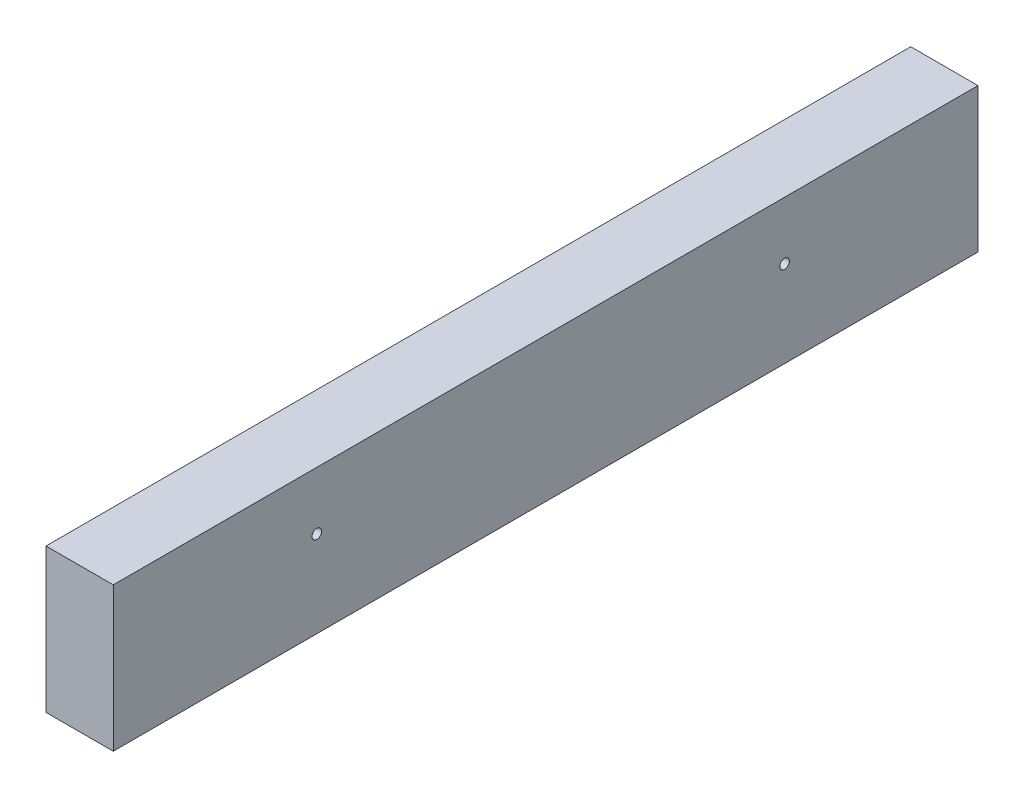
ISO-10303-21;
HEADER;
FILE_DESCRIPTION(('STEP AP214'),'2;1');
FILE_NAME('part.step','',(''),(''),'','','');
FILE_SCHEMA(('AUTOMOTIVE_DESIGN { 1 0 10303 214 1 1 1 1 }'));
ENDSEC;
DATA;
#1=APPLICATION_CONTEXT('core data for automotive mechanical design processes');
#2=APPLICATION_PROTOCOL_DEFINITION('international standard','automotive_design',2000,#1);
#3=PRODUCT_CONTEXT('',#1,'mechanical');
#4=PRODUCT('Part','Part','',(#3));
#5=PRODUCT_RELATED_PRODUCT_CATEGORY('part','',(#4));
#6=PRODUCT_DEFINITION_FORMATION('','',#4);
#7=PRODUCT_DEFINITION_CONTEXT('part definition',#1,'design');
#8=PRODUCT_DEFINITION('design','',#6,#7);
#9=PRODUCT_DEFINITION_SHAPE('','',#8);
#10=(LENGTH_UNIT() NAMED_UNIT(*) SI_UNIT(.MILLI.,.METRE.));
#11=(NAMED_UNIT(*) PLANE_ANGLE_UNIT() SI_UNIT($,.RADIAN.));
#12=(NAMED_UNIT(*) SI_UNIT($,.STERADIAN.) SOLID_ANGLE_UNIT());
#13=UNCERTAINTY_MEASURE_WITH_UNIT(LENGTH_MEASURE(1.E-05),#10,'distance_accuracy_value','');
#14=(GEOMETRIC_REPRESENTATION_CONTEXT(3) GLOBAL_UNCERTAINTY_ASSIGNED_CONTEXT((#13)) GLOBAL_UNIT_ASSIGNED_CONTEXT((#10,
#11,#12)) REPRESENTATION_CONTEXT('',''));
#15=CARTESIAN_POINT('',(0.,0.,0.));
#16=DIRECTION('',(0.,0.,1.));
#17=DIRECTION('',(1.,0.,0.));
#18=AXIS2_PLACEMENT_3D('',#15,#16,#17);
#19=CARTESIAN_POINT('',(-9.398,566.112211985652,-360.901203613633));
#20=DIRECTION('',(1.,0.,0.));
#21=DIRECTION('',(0.,0.,-1.));
#22=AXIS2_PLACEMENT_3D('',#19,#20,#21);
#23=PLANE('',#22);
#24=CARTESIAN_POINT('',(-9.398,566.112211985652,-360.901203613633));
#25=DIRECTION('',(1.,0.,0.));
#26=DIRECTION('',(0.,0.,-1.));
#27=AXIS2_PLACEMENT_3D('',#24,#25,#26);
#28=CIRCLE('',#27,1.27000000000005);
#29=CARTESIAN_POINT('',(-9.398,566.112211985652,-362.171203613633));
#30=VERTEX_POINT('',#29);
#31=EDGE_CURVE('E35',#30,#30,#28,.T.);
#32=ORIENTED_EDGE('',*,*,#31,.T.);
#33=EDGE_LOOP('',(#32));
#34=FACE_BOUND('',#33,.T.);
#35=ADVANCED_FACE('F32',(#34),#23,.T.);
#36=CARTESIAN_POINT('',(-9.398,566.112211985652,-237.255677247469));
#37=DIRECTION('',(1.,0.,0.));
#38=DIRECTION('',(0.,0.,-1.));
#39=AXIS2_PLACEMENT_3D('',#36,#37,#38);
#40=PLANE('',#39);
#41=CARTESIAN_POINT('',(-9.398,566.112211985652,-237.255677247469));
#42=DIRECTION('',(1.,0.,0.));
#43=DIRECTION('',(0.,0.,-1.));
#44=AXIS2_PLACEMENT_3D('',#41,#42,#43);
#45=CIRCLE('',#44,1.27000000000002);
#46=CARTESIAN_POINT('',(-9.398,566.112211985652,-238.525677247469));
#47=VERTEX_POINT('',#46);
#48=EDGE_CURVE('E120',#47,#47,#45,.T.);
#49=ORIENTED_EDGE('',*,*,#48,.T.);
#50=EDGE_LOOP('',(#49));
#51=FACE_BOUND('',#50,.T.);
#52=ADVANCED_FACE('F131',(#51),#40,.T.);
#53=CARTESIAN_POINT('',(-9.398,566.112211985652,-360.901203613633));
#54=DIRECTION('',(1.,0.,0.));
#55=DIRECTION('',(0.,0.,-1.));
#56=AXIS2_PLACEMENT_3D('',#53,#54,#55);
#57=CYLINDRICAL_SURFACE('',#56,1.27000000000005);
#58=CARTESIAN_POINT('',(0.,566.112211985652,-360.901203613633));
#59=DIRECTION('',(1.,0.,0.));
#60=DIRECTION('',(0.,0.,-1.));
#61=AXIS2_PLACEMENT_3D('',#58,#59,#60);
#62=CIRCLE('',#61,1.27000000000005);
#63=CARTESIAN_POINT('',(0.,566.112211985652,-362.171203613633));
#64=VERTEX_POINT('',#63);
#65=EDGE_CURVE('E118',#64,#64,#62,.T.);
#66=ORIENTED_EDGE('',*,*,#65,.T.);
#67=EDGE_LOOP('',(#66));
#68=FACE_BOUND('',#67,.T.);
#69=ORIENTED_EDGE('',*,*,#31,.F.);
#70=EDGE_LOOP('',(#69));
#71=FACE_BOUND('',#70,.T.);
#72=ADVANCED_FACE('F128',(#68,#71),#57,.F.);
#73=CARTESIAN_POINT('',(-9.398,566.112211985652,-237.255677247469));
#74=DIRECTION('',(1.,0.,0.));
#75=DIRECTION('',(0.,0.,-1.));
#76=AXIS2_PLACEMENT_3D('',#73,#74,#75);
#77=CYLINDRICAL_SURFACE('',#76,1.27000000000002);
#78=CARTESIAN_POINT('',(0.,566.112211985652,-237.255677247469));
#79=DIRECTION('',(1.,0.,0.));
#80=DIRECTION('',(0.,0.,-1.));
#81=AXIS2_PLACEMENT_3D('',#78,#79,#80);
#82=CIRCLE('',#81,1.27000000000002);
#83=CARTESIAN_POINT('',(0.,566.112211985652,-238.525677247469));
#84=VERTEX_POINT('',#83);
#85=EDGE_CURVE('E81',#84,#84,#82,.T.);
#86=ORIENTED_EDGE('',*,*,#85,.T.);
#87=EDGE_LOOP('',(#86));
#88=FACE_BOUND('',#87,.T.);
#89=ORIENTED_EDGE('',*,*,#48,.F.);
#90=EDGE_LOOP('',(#89));
#91=FACE_BOUND('',#90,.T.);
#92=ADVANCED_FACE('F130',(#88,#91),#77,.F.);
#93=CARTESIAN_POINT('',(0.,0.,0.));
#94=DIRECTION('',(-1.,0.,0.));
#95=DIRECTION('',(0.,0.,1.));
#96=AXIS2_PLACEMENT_3D('',#93,#94,#95);
#97=PLANE('',#96);
#98=DIRECTION('',(0.,1.,0.));
#99=VECTOR('',#98,1.);
#100=CARTESIAN_POINT('',(0.,0.,-412.03537714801));
#101=LINE('',#100,#99);
#102=CARTESIAN_POINT('',(0.,543.252211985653,-412.03537714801));
#103=VERTEX_POINT('',#102);
#104=CARTESIAN_POINT('',(0.,581.352211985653,-412.03537714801));
#105=VERTEX_POINT('',#104);
#106=EDGE_CURVE('E87',#103,#105,#101,.T.);
#107=ORIENTED_EDGE('',*,*,#106,.T.);
#108=DIRECTION('',(0.,0.,-1.));
#109=VECTOR('',#108,1.);
#110=CARTESIAN_POINT('',(0.,581.352211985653,0.));
#111=LINE('',#110,#109);
#112=CARTESIAN_POINT('',(0.,581.352211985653,-183.43537714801));
#113=VERTEX_POINT('',#112);
#114=EDGE_CURVE('E84',#105,#113,#111,.F.);
#115=ORIENTED_EDGE('',*,*,#114,.T.);
#116=DIRECTION('',(0.,-1.,0.));
#117=VECTOR('',#116,1.);
#118=CARTESIAN_POINT('',(0.,0.,-183.43537714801));
#119=LINE('',#118,#117);
#120=CARTESIAN_POINT('',(0.,543.252211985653,-183.43537714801));
#121=VERTEX_POINT('',#120);
#122=EDGE_CURVE('E71',#121,#113,#119,.F.);
#123=ORIENTED_EDGE('',*,*,#122,.F.);
#124=DIRECTION('',(0.,0.,-1.));
#125=VECTOR('',#124,1.);
#126=CARTESIAN_POINT('',(0.,543.252211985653,0.));
#127=LINE('',#126,#125);
#128=EDGE_CURVE('E113',#103,#121,#127,.F.);
#129=ORIENTED_EDGE('',*,*,#128,.F.);
#130=EDGE_LOOP('',(#107,#115,#123,#129));
#131=FACE_BOUND('',#130,.T.);
#132=ORIENTED_EDGE('',*,*,#85,.F.);
#133=EDGE_LOOP('',(#132));
#134=FACE_BOUND('',#133,.T.);
#135=ORIENTED_EDGE('',*,*,#65,.F.);
#136=EDGE_LOOP('',(#135));
#137=FACE_BOUND('',#136,.T.);
#138=ADVANCED_FACE('F85',(#131,#134,#137),#97,.F.);
#139=CARTESIAN_POINT('',(-17.78,0.,-183.43537714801));
#140=DIRECTION('',(0.,0.,1.));
#141=DIRECTION('',(0.,-1.,0.));
#142=AXIS2_PLACEMENT_3D('',#139,#140,#141);
#143=PLANE('',#142);
#144=DIRECTION('',(0.,1.,0.));
#145=VECTOR('',#144,1.);
#146=CARTESIAN_POINT('',(-17.78,0.,-183.43537714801));
#147=LINE('',#146,#145);
#148=CARTESIAN_POINT('',(-17.78,543.252211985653,-183.43537714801));
#149=VERTEX_POINT('',#148);
#150=CARTESIAN_POINT('',(-17.78,581.352211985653,-183.43537714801));
#151=VERTEX_POINT('',#150);
#152=EDGE_CURVE('E106',#149,#151,#147,.T.);
#153=ORIENTED_EDGE('',*,*,#152,.F.);
#154=DIRECTION('',(1.,0.,0.));
#155=VECTOR('',#154,1.);
#156=CARTESIAN_POINT('',(-17.78,543.252211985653,-183.43537714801));
#157=LINE('',#156,#155);
#158=EDGE_CURVE('E78',#121,#149,#157,.F.);
#159=ORIENTED_EDGE('',*,*,#158,.F.);
#160=ORIENTED_EDGE('',*,*,#122,.T.);
#161=DIRECTION('',(1.,0.,0.));
#162=VECTOR('',#161,1.);
#163=CARTESIAN_POINT('',(-17.78,581.352211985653,-183.43537714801));
#164=LINE('',#163,#162);
#165=EDGE_CURVE('E75',#113,#151,#164,.F.);
#166=ORIENTED_EDGE('',*,*,#165,.T.);
#167=EDGE_LOOP('',(#153,#159,#160,#166));
#168=FACE_BOUND('',#167,.T.);
#169=ADVANCED_FACE('F73',(#168),#143,.T.);
#170=CARTESIAN_POINT('',(-17.78,581.352211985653,0.));
#171=DIRECTION('',(0.,-1.,0.));
#172=DIRECTION('',(0.,0.,-1.));
#173=AXIS2_PLACEMENT_3D('',#170,#171,#172);
#174=PLANE('',#173);
#175=DIRECTION('',(1.,0.,0.));
#176=VECTOR('',#175,1.);
#177=CARTESIAN_POINT('',(-17.78,581.352211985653,-412.03537714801));
#178=LINE('',#177,#176);
#179=CARTESIAN_POINT('',(-17.78,581.352211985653,-412.03537714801));
#180=VERTEX_POINT('',#179);
#181=EDGE_CURVE('E90',#105,#180,#178,.F.);
#182=ORIENTED_EDGE('',*,*,#181,.T.);
#183=DIRECTION('',(0.,0.,1.));
#184=VECTOR('',#183,1.);
#185=CARTESIAN_POINT('',(-17.78,581.352211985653,0.));
#186=LINE('',#185,#184);
#187=EDGE_CURVE('E94',#151,#180,#186,.F.);
#188=ORIENTED_EDGE('',*,*,#187,.F.);
#189=ORIENTED_EDGE('',*,*,#165,.F.);
#190=ORIENTED_EDGE('',*,*,#114,.F.);
#191=EDGE_LOOP('',(#182,#188,#189,#190));
#192=FACE_BOUND('',#191,.T.);
#193=ADVANCED_FACE('F92',(#192),#174,.F.);
#194=CARTESIAN_POINT('',(-17.78,0.,-412.03537714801));
#195=DIRECTION('',(0.,0.,1.));
#196=DIRECTION('',(1.,0.,0.));
#197=AXIS2_PLACEMENT_3D('',#194,#195,#196);
#198=PLANE('',#197);
#199=ORIENTED_EDGE('',*,*,#181,.F.);
#200=ORIENTED_EDGE('',*,*,#106,.F.);
#201=DIRECTION('',(1.,0.,0.));
#202=VECTOR('',#201,1.);
#203=CARTESIAN_POINT('',(-17.78,543.252211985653,-412.03537714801));
#204=LINE('',#203,#202);
#205=CARTESIAN_POINT('',(-17.78,543.252211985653,-412.03537714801));
#206=VERTEX_POINT('',#205);
#207=EDGE_CURVE('E50',#206,#103,#204,.T.);
#208=ORIENTED_EDGE('',*,*,#207,.F.);
#209=DIRECTION('',(0.,1.,0.));
#210=VECTOR('',#209,1.);
#211=CARTESIAN_POINT('',(-17.78,0.,-412.03537714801));
#212=LINE('',#211,#210);
#213=EDGE_CURVE('E41',#180,#206,#212,.F.);
#214=ORIENTED_EDGE('',*,*,#213,.F.);
#215=EDGE_LOOP('',(#199,#200,#208,#214));
#216=FACE_BOUND('',#215,.T.);
#217=ADVANCED_FACE('F148',(#216),#198,.F.);
#218=CARTESIAN_POINT('',(-17.78,543.252211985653,0.));
#219=DIRECTION('',(0.,-1.,0.));
#220=DIRECTION('',(0.,0.,-1.));
#221=AXIS2_PLACEMENT_3D('',#218,#219,#220);
#222=PLANE('',#221);
#223=DIRECTION('',(0.,0.,1.));
#224=VECTOR('',#223,1.);
#225=CARTESIAN_POINT('',(-17.78,543.252211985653,0.));
#226=LINE('',#225,#224);
#227=EDGE_CURVE('E11',#206,#149,#226,.T.);
#228=ORIENTED_EDGE('',*,*,#227,.F.);
#229=ORIENTED_EDGE('',*,*,#207,.T.);
#230=ORIENTED_EDGE('',*,*,#128,.T.);
#231=ORIENTED_EDGE('',*,*,#158,.T.);
#232=EDGE_LOOP('',(#228,#229,#230,#231));
#233=FACE_BOUND('',#232,.T.);
#234=ADVANCED_FACE('F142',(#233),#222,.T.);
#235=CARTESIAN_POINT('',(-17.78,0.,0.));
#236=DIRECTION('',(-1.,0.,0.));
#237=DIRECTION('',(0.,0.,1.));
#238=AXIS2_PLACEMENT_3D('',#235,#236,#237);
#239=PLANE('',#238);
#240=ORIENTED_EDGE('',*,*,#213,.T.);
#241=ORIENTED_EDGE('',*,*,#227,.T.);
#242=ORIENTED_EDGE('',*,*,#152,.T.);
#243=ORIENTED_EDGE('',*,*,#187,.T.);
#244=EDGE_LOOP('',(#240,#241,#242,#243));
#245=FACE_BOUND('',#244,.T.);
#246=ADVANCED_FACE('F140',(#245),#239,.T.);
#247=CLOSED_SHELL('',(#35,#52,#72,#92,#138,#169,#193,#217,#234,#246));
#248=MANIFOLD_SOLID_BREP('B2',#247);
#249=ADVANCED_BREP_SHAPE_REPRESENTATION('',(#18,#248),#14);
#250=SHAPE_DEFINITION_REPRESENTATION(#9,#249);
ENDSEC;
END-ISO-10303-21;
